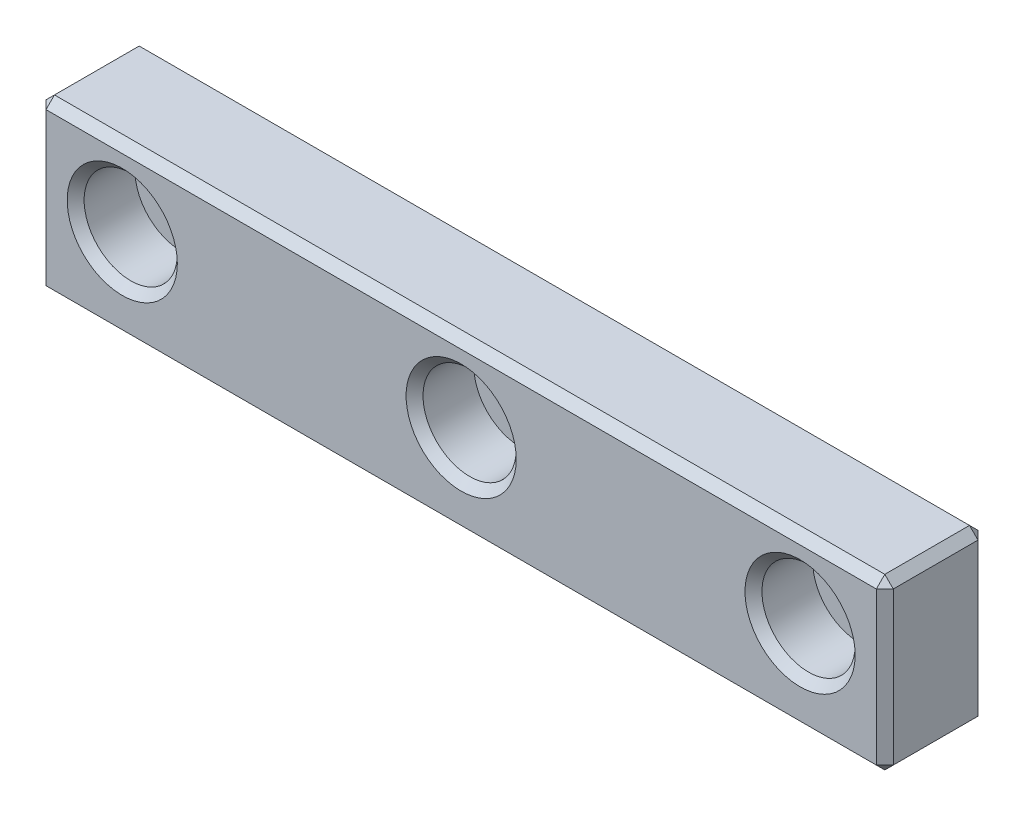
ISO-10303-21;
HEADER;
FILE_DESCRIPTION(('STEP AP214'),'2;1');
FILE_NAME('part.step','',(''),(''),'','','');
FILE_SCHEMA(('AUTOMOTIVE_DESIGN { 1 0 10303 214 1 1 1 1 }'));
ENDSEC;
DATA;
#1=APPLICATION_CONTEXT('core data for automotive mechanical design processes');
#2=APPLICATION_PROTOCOL_DEFINITION('international standard','automotive_design',2000,#1);
#3=PRODUCT_CONTEXT('',#1,'mechanical');
#4=PRODUCT('Part','Part','',(#3));
#5=PRODUCT_RELATED_PRODUCT_CATEGORY('part','',(#4));
#6=PRODUCT_DEFINITION_FORMATION('','',#4);
#7=PRODUCT_DEFINITION_CONTEXT('part definition',#1,'design');
#8=PRODUCT_DEFINITION('design','',#6,#7);
#9=PRODUCT_DEFINITION_SHAPE('','',#8);
#10=(LENGTH_UNIT() NAMED_UNIT(*) SI_UNIT(.MILLI.,.METRE.));
#11=(NAMED_UNIT(*) PLANE_ANGLE_UNIT() SI_UNIT($,.RADIAN.));
#12=(NAMED_UNIT(*) SI_UNIT($,.STERADIAN.) SOLID_ANGLE_UNIT());
#13=UNCERTAINTY_MEASURE_WITH_UNIT(LENGTH_MEASURE(1.E-05),#10,'distance_accuracy_value','');
#14=(GEOMETRIC_REPRESENTATION_CONTEXT(3) GLOBAL_UNCERTAINTY_ASSIGNED_CONTEXT((#13)) GLOBAL_UNIT_ASSIGNED_CONTEXT((#10,
#11,#12)) REPRESENTATION_CONTEXT('',''));
#15=CARTESIAN_POINT('',(0.,0.,0.));
#16=DIRECTION('',(0.,0.,1.));
#17=DIRECTION('',(1.,0.,0.));
#18=AXIS2_PLACEMENT_3D('',#15,#16,#17);
#19=CARTESIAN_POINT('',(-40.,1.,12.));
#20=DIRECTION('',(0.,0.,-1.));
#21=DIRECTION('',(-1.,0.,0.));
#22=AXIS2_PLACEMENT_3D('',#19,#20,#21);
#23=CYLINDRICAL_SURFACE('',#22,3.);
#24=CARTESIAN_POINT('',(-40.,1.,1.00000000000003));
#25=DIRECTION('',(0.,0.,1.));
#26=DIRECTION('',(1.,0.,0.));
#27=AXIS2_PLACEMENT_3D('',#24,#25,#26);
#28=CIRCLE('',#27,3.);
#29=CARTESIAN_POINT('',(-37.,1.,1.00000000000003));
#30=VERTEX_POINT('',#29);
#31=EDGE_CURVE('E162',#30,#30,#28,.F.);
#32=ORIENTED_EDGE('',*,*,#31,.T.);
#33=EDGE_LOOP('',(#32));
#34=FACE_BOUND('',#33,.T.);
#35=CARTESIAN_POINT('',(-40.,1.,5.));
#36=DIRECTION('',(0.,0.,1.));
#37=DIRECTION('',(1.,0.,0.));
#38=AXIS2_PLACEMENT_3D('',#35,#36,#37);
#39=CIRCLE('',#38,3.);
#40=CARTESIAN_POINT('',(-37.,1.,5.));
#41=VERTEX_POINT('',#40);
#42=EDGE_CURVE('E137',#41,#41,#39,.T.);
#43=ORIENTED_EDGE('',*,*,#42,.T.);
#44=EDGE_LOOP('',(#43));
#45=FACE_BOUND('',#44,.T.);
#46=ADVANCED_FACE('F16',(#34,#45),#23,.F.);
#47=CARTESIAN_POINT('',(0.,1.,12.));
#48=DIRECTION('',(0.,0.,-1.));
#49=DIRECTION('',(-1.,0.,0.));
#50=AXIS2_PLACEMENT_3D('',#47,#48,#49);
#51=CYLINDRICAL_SURFACE('',#50,3.);
#52=CARTESIAN_POINT('',(0.,1.,1.));
#53=DIRECTION('',(0.,0.,1.));
#54=DIRECTION('',(1.,0.,0.));
#55=AXIS2_PLACEMENT_3D('',#52,#53,#54);
#56=CIRCLE('',#55,3.);
#57=CARTESIAN_POINT('',(3.00000000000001,1.,1.));
#58=VERTEX_POINT('',#57);
#59=EDGE_CURVE('E159',#58,#58,#56,.F.);
#60=ORIENTED_EDGE('',*,*,#59,.T.);
#61=EDGE_LOOP('',(#60));
#62=FACE_BOUND('',#61,.T.);
#63=CARTESIAN_POINT('',(0.,1.,5.));
#64=DIRECTION('',(0.,0.,1.));
#65=DIRECTION('',(1.,0.,0.));
#66=AXIS2_PLACEMENT_3D('',#63,#64,#65);
#67=CIRCLE('',#66,3.);
#68=CARTESIAN_POINT('',(3.00000000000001,1.,5.));
#69=VERTEX_POINT('',#68);
#70=EDGE_CURVE('E293',#69,#69,#67,.T.);
#71=ORIENTED_EDGE('',*,*,#70,.T.);
#72=EDGE_LOOP('',(#71));
#73=FACE_BOUND('',#72,.T.);
#74=ADVANCED_FACE('F322',(#62,#73),#51,.F.);
#75=CARTESIAN_POINT('',(40.,1.,12.));
#76=DIRECTION('',(0.,0.,-1.));
#77=DIRECTION('',(-1.,0.,0.));
#78=AXIS2_PLACEMENT_3D('',#75,#76,#77);
#79=CYLINDRICAL_SURFACE('',#78,3.);
#80=CARTESIAN_POINT('',(40.,1.,1.00000000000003));
#81=DIRECTION('',(0.,0.,1.));
#82=DIRECTION('',(1.,0.,0.));
#83=AXIS2_PLACEMENT_3D('',#80,#81,#82);
#84=CIRCLE('',#83,3.);
#85=CARTESIAN_POINT('',(43.,1.,1.00000000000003));
#86=VERTEX_POINT('',#85);
#87=EDGE_CURVE('E156',#86,#86,#84,.F.);
#88=ORIENTED_EDGE('',*,*,#87,.T.);
#89=EDGE_LOOP('',(#88));
#90=FACE_BOUND('',#89,.T.);
#91=CARTESIAN_POINT('',(40.,1.,5.));
#92=DIRECTION('',(0.,0.,1.));
#93=DIRECTION('',(1.,0.,0.));
#94=AXIS2_PLACEMENT_3D('',#91,#92,#93);
#95=CIRCLE('',#94,3.);
#96=CARTESIAN_POINT('',(43.,1.,5.));
#97=VERTEX_POINT('',#96);
#98=EDGE_CURVE('E290',#97,#97,#95,.T.);
#99=ORIENTED_EDGE('',*,*,#98,.T.);
#100=EDGE_LOOP('',(#99));
#101=FACE_BOUND('',#100,.T.);
#102=ADVANCED_FACE('F329',(#90,#101),#79,.F.);
#103=CARTESIAN_POINT('',(0.,0.,12.));
#104=DIRECTION('',(0.,0.,1.));
#105=DIRECTION('',(1.,0.,0.));
#106=AXIS2_PLACEMENT_3D('',#103,#104,#105);
#107=PLANE('',#106);
#108=DIRECTION('',(0.,1.,0.));
#109=VECTOR('',#108,1.);
#110=CARTESIAN_POINT('',(49.,10.,12.));
#111=LINE('',#110,#109);
#112=CARTESIAN_POINT('',(49.,-9.,12.));
#113=VERTEX_POINT('',#112);
#114=CARTESIAN_POINT('',(49.,9.,12.));
#115=VERTEX_POINT('',#114);
#116=EDGE_CURVE('E33',#113,#115,#111,.T.);
#117=ORIENTED_EDGE('',*,*,#116,.T.);
#118=DIRECTION('',(-1.,0.,0.));
#119=VECTOR('',#118,1.);
#120=CARTESIAN_POINT('',(-50.,9.,12.));
#121=LINE('',#120,#119);
#122=CARTESIAN_POINT('',(-49.,9.,12.));
#123=VERTEX_POINT('',#122);
#124=EDGE_CURVE('E212',#115,#123,#121,.T.);
#125=ORIENTED_EDGE('',*,*,#124,.T.);
#126=DIRECTION('',(0.,-1.,0.));
#127=VECTOR('',#126,1.);
#128=CARTESIAN_POINT('',(-49.,-10.,12.));
#129=LINE('',#128,#127);
#130=CARTESIAN_POINT('',(-49.,-9.,12.));
#131=VERTEX_POINT('',#130);
#132=EDGE_CURVE('E208',#123,#131,#129,.T.);
#133=ORIENTED_EDGE('',*,*,#132,.T.);
#134=DIRECTION('',(1.,0.,0.));
#135=VECTOR('',#134,1.);
#136=CARTESIAN_POINT('',(50.,-9.,12.));
#137=LINE('',#136,#135);
#138=EDGE_CURVE('E38',#131,#113,#137,.T.);
#139=ORIENTED_EDGE('',*,*,#138,.T.);
#140=EDGE_LOOP('',(#117,#125,#133,#139));
#141=FACE_BOUND('',#140,.T.);
#142=CARTESIAN_POINT('',(40.,1.,12.));
#143=DIRECTION('',(0.,0.,1.));
#144=DIRECTION('',(1.,0.,0.));
#145=AXIS2_PLACEMENT_3D('',#142,#143,#144);
#146=CIRCLE('',#145,6.5);
#147=CARTESIAN_POINT('',(46.5,1.,12.));
#148=VERTEX_POINT('',#147);
#149=EDGE_CURVE('E205',#148,#148,#146,.F.);
#150=ORIENTED_EDGE('',*,*,#149,.T.);
#151=EDGE_LOOP('',(#150));
#152=FACE_BOUND('',#151,.T.);
#153=CARTESIAN_POINT('',(0.,1.,12.));
#154=DIRECTION('',(0.,0.,1.));
#155=DIRECTION('',(1.,0.,0.));
#156=AXIS2_PLACEMENT_3D('',#153,#154,#155);
#157=CIRCLE('',#156,6.5);
#158=CARTESIAN_POINT('',(6.50000000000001,1.,12.));
#159=VERTEX_POINT('',#158);
#160=EDGE_CURVE('E202',#159,#159,#157,.F.);
#161=ORIENTED_EDGE('',*,*,#160,.T.);
#162=EDGE_LOOP('',(#161));
#163=FACE_BOUND('',#162,.T.);
#164=CARTESIAN_POINT('',(-40.,1.,12.));
#165=DIRECTION('',(0.,0.,1.));
#166=DIRECTION('',(1.,0.,0.));
#167=AXIS2_PLACEMENT_3D('',#164,#165,#166);
#168=CIRCLE('',#167,6.5);
#169=CARTESIAN_POINT('',(-33.5,1.,12.));
#170=VERTEX_POINT('',#169);
#171=EDGE_CURVE('E199',#170,#170,#168,.F.);
#172=ORIENTED_EDGE('',*,*,#171,.T.);
#173=EDGE_LOOP('',(#172));
#174=FACE_BOUND('',#173,.T.);
#175=ADVANCED_FACE('F334',(#141,#152,#163,#174),#107,.T.);
#176=CARTESIAN_POINT('',(0.,0.,0.));
#177=DIRECTION('',(0.,0.,1.));
#178=DIRECTION('',(1.,0.,0.));
#179=AXIS2_PLACEMENT_3D('',#176,#177,#178);
#180=PLANE('',#179);
#181=CARTESIAN_POINT('',(40.,1.,0.));
#182=DIRECTION('',(0.,0.,1.));
#183=DIRECTION('',(1.,0.,0.));
#184=AXIS2_PLACEMENT_3D('',#181,#182,#183);
#185=CIRCLE('',#184,4.);
#186=CARTESIAN_POINT('',(44.,1.,0.));
#187=VERTEX_POINT('',#186);
#188=EDGE_CURVE('E153',#187,#187,#185,.T.);
#189=ORIENTED_EDGE('',*,*,#188,.T.);
#190=EDGE_LOOP('',(#189));
#191=FACE_BOUND('',#190,.T.);
#192=CARTESIAN_POINT('',(0.,1.,0.));
#193=DIRECTION('',(0.,0.,1.));
#194=DIRECTION('',(1.,0.,0.));
#195=AXIS2_PLACEMENT_3D('',#192,#193,#194);
#196=CIRCLE('',#195,4.);
#197=CARTESIAN_POINT('',(4.00000000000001,1.,0.));
#198=VERTEX_POINT('',#197);
#199=EDGE_CURVE('E150',#198,#198,#196,.T.);
#200=ORIENTED_EDGE('',*,*,#199,.T.);
#201=EDGE_LOOP('',(#200));
#202=FACE_BOUND('',#201,.T.);
#203=CARTESIAN_POINT('',(-40.,1.,0.));
#204=DIRECTION('',(0.,0.,1.));
#205=DIRECTION('',(1.,0.,0.));
#206=AXIS2_PLACEMENT_3D('',#203,#204,#205);
#207=CIRCLE('',#206,4.);
#208=CARTESIAN_POINT('',(-36.,1.,0.));
#209=VERTEX_POINT('',#208);
#210=EDGE_CURVE('E144',#209,#209,#207,.T.);
#211=ORIENTED_EDGE('',*,*,#210,.T.);
#212=EDGE_LOOP('',(#211));
#213=FACE_BOUND('',#212,.T.);
#214=DIRECTION('',(0.,1.,0.));
#215=VECTOR('',#214,1.);
#216=CARTESIAN_POINT('',(-49.,0.,0.));
#217=LINE('',#216,#215);
#218=CARTESIAN_POINT('',(-49.,-9.,0.));
#219=VERTEX_POINT('',#218);
#220=CARTESIAN_POINT('',(-49.,9.,0.));
#221=VERTEX_POINT('',#220);
#222=EDGE_CURVE('E136',#219,#221,#217,.T.);
#223=ORIENTED_EDGE('',*,*,#222,.T.);
#224=DIRECTION('',(1.,0.,0.));
#225=VECTOR('',#224,1.);
#226=CARTESIAN_POINT('',(0.,9.,0.));
#227=LINE('',#226,#225);
#228=CARTESIAN_POINT('',(49.,9.,0.));
#229=VERTEX_POINT('',#228);
#230=EDGE_CURVE('E141',#221,#229,#227,.T.);
#231=ORIENTED_EDGE('',*,*,#230,.T.);
#232=DIRECTION('',(0.,-1.,0.));
#233=VECTOR('',#232,1.);
#234=CARTESIAN_POINT('',(49.,0.,0.));
#235=LINE('',#234,#233);
#236=CARTESIAN_POINT('',(49.,-9.,0.));
#237=VERTEX_POINT('',#236);
#238=EDGE_CURVE('E111',#229,#237,#235,.T.);
#239=ORIENTED_EDGE('',*,*,#238,.T.);
#240=DIRECTION('',(-1.,0.,0.));
#241=VECTOR('',#240,1.);
#242=CARTESIAN_POINT('',(0.,-9.,0.));
#243=LINE('',#242,#241);
#244=EDGE_CURVE('E130',#237,#219,#243,.T.);
#245=ORIENTED_EDGE('',*,*,#244,.T.);
#246=EDGE_LOOP('',(#223,#231,#239,#245));
#247=FACE_BOUND('',#246,.T.);
#248=ADVANCED_FACE('F139',(#191,#202,#213,#247),#180,.F.);
#249=CARTESIAN_POINT('',(-50.,-10.,12.));
#250=DIRECTION('',(1.,0.,0.));
#251=DIRECTION('',(0.,0.,-1.));
#252=AXIS2_PLACEMENT_3D('',#249,#250,#251);
#253=PLANE('',#252);
#254=DIRECTION('',(0.,0.,-1.));
#255=VECTOR('',#254,1.);
#256=CARTESIAN_POINT('',(-50.,9.,12.));
#257=LINE('',#256,#255);
#258=CARTESIAN_POINT('',(-50.,9.,11.));
#259=VERTEX_POINT('',#258);
#260=CARTESIAN_POINT('',(-50.,9.,1.00000000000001));
#261=VERTEX_POINT('',#260);
#262=EDGE_CURVE('E176',#259,#261,#257,.T.);
#263=ORIENTED_EDGE('',*,*,#262,.T.);
#264=DIRECTION('',(0.,-1.,0.));
#265=VECTOR('',#264,1.);
#266=CARTESIAN_POINT('',(-50.,-10.,1.00000000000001));
#267=LINE('',#266,#265);
#268=CARTESIAN_POINT('',(-50.,-9.,1.00000000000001));
#269=VERTEX_POINT('',#268);
#270=EDGE_CURVE('E178',#261,#269,#267,.T.);
#271=ORIENTED_EDGE('',*,*,#270,.T.);
#272=DIRECTION('',(0.,0.,1.));
#273=VECTOR('',#272,1.);
#274=CARTESIAN_POINT('',(-50.,-9.,12.));
#275=LINE('',#274,#273);
#276=CARTESIAN_POINT('',(-50.,-9.,11.));
#277=VERTEX_POINT('',#276);
#278=EDGE_CURVE('E174',#269,#277,#275,.T.);
#279=ORIENTED_EDGE('',*,*,#278,.T.);
#280=DIRECTION('',(0.,1.,0.));
#281=VECTOR('',#280,1.);
#282=CARTESIAN_POINT('',(-50.,10.,11.));
#283=LINE('',#282,#281);
#284=EDGE_CURVE('E172',#277,#259,#283,.T.);
#285=ORIENTED_EDGE('',*,*,#284,.T.);
#286=EDGE_LOOP('',(#263,#271,#279,#285));
#287=FACE_BOUND('',#286,.T.);
#288=ADVANCED_FACE('F339',(#287),#253,.F.);
#289=CARTESIAN_POINT('',(50.,-10.,12.));
#290=DIRECTION('',(0.,1.,0.));
#291=DIRECTION('',(-1.,0.,0.));
#292=AXIS2_PLACEMENT_3D('',#289,#290,#291);
#293=PLANE('',#292);
#294=DIRECTION('',(-1.,0.,0.));
#295=VECTOR('',#294,1.);
#296=CARTESIAN_POINT('',(-50.,-10.,11.));
#297=LINE('',#296,#295);
#298=CARTESIAN_POINT('',(49.,-10.,11.));
#299=VERTEX_POINT('',#298);
#300=CARTESIAN_POINT('',(-49.,-10.,11.));
#301=VERTEX_POINT('',#300);
#302=EDGE_CURVE('E190',#299,#301,#297,.T.);
#303=ORIENTED_EDGE('',*,*,#302,.T.);
#304=DIRECTION('',(0.,0.,-1.));
#305=VECTOR('',#304,1.);
#306=CARTESIAN_POINT('',(-49.,-10.,12.));
#307=LINE('',#306,#305);
#308=CARTESIAN_POINT('',(-49.,-10.,1.));
#309=VERTEX_POINT('',#308);
#310=EDGE_CURVE('E196',#301,#309,#307,.T.);
#311=ORIENTED_EDGE('',*,*,#310,.T.);
#312=DIRECTION('',(1.,0.,0.));
#313=VECTOR('',#312,1.);
#314=CARTESIAN_POINT('',(50.,-10.,1.));
#315=LINE('',#314,#313);
#316=CARTESIAN_POINT('',(49.,-10.,1.));
#317=VERTEX_POINT('',#316);
#318=EDGE_CURVE('E194',#309,#317,#315,.T.);
#319=ORIENTED_EDGE('',*,*,#318,.T.);
#320=DIRECTION('',(0.,0.,1.));
#321=VECTOR('',#320,1.);
#322=CARTESIAN_POINT('',(49.,-10.,12.));
#323=LINE('',#322,#321);
#324=EDGE_CURVE('E192',#317,#299,#323,.T.);
#325=ORIENTED_EDGE('',*,*,#324,.T.);
#326=EDGE_LOOP('',(#303,#311,#319,#325));
#327=FACE_BOUND('',#326,.T.);
#328=ADVANCED_FACE('F349',(#327),#293,.F.);
#329=CARTESIAN_POINT('',(50.,-10.,12.));
#330=DIRECTION('',(-1.,0.,0.));
#331=DIRECTION('',(0.,0.,1.));
#332=AXIS2_PLACEMENT_3D('',#329,#330,#331);
#333=PLANE('',#332);
#334=DIRECTION('',(0.,0.,-1.));
#335=VECTOR('',#334,1.);
#336=CARTESIAN_POINT('',(50.,-9.,12.));
#337=LINE('',#336,#335);
#338=CARTESIAN_POINT('',(50.,-9.,11.));
#339=VERTEX_POINT('',#338);
#340=CARTESIAN_POINT('',(50.,-9.,1.));
#341=VERTEX_POINT('',#340);
#342=EDGE_CURVE('E167',#339,#341,#337,.T.);
#343=ORIENTED_EDGE('',*,*,#342,.T.);
#344=DIRECTION('',(0.,1.,0.));
#345=VECTOR('',#344,1.);
#346=CARTESIAN_POINT('',(50.,-10.,1.));
#347=LINE('',#346,#345);
#348=CARTESIAN_POINT('',(50.,9.,1.));
#349=VERTEX_POINT('',#348);
#350=EDGE_CURVE('E114',#341,#349,#347,.T.);
#351=ORIENTED_EDGE('',*,*,#350,.T.);
#352=DIRECTION('',(0.,0.,1.));
#353=VECTOR('',#352,1.);
#354=CARTESIAN_POINT('',(50.,9.,12.));
#355=LINE('',#354,#353);
#356=CARTESIAN_POINT('',(50.,9.,11.));
#357=VERTEX_POINT('',#356);
#358=EDGE_CURVE('E169',#349,#357,#355,.T.);
#359=ORIENTED_EDGE('',*,*,#358,.T.);
#360=DIRECTION('',(0.,-1.,0.));
#361=VECTOR('',#360,1.);
#362=CARTESIAN_POINT('',(50.,-10.,11.));
#363=LINE('',#362,#361);
#364=EDGE_CURVE('E165',#357,#339,#363,.T.);
#365=ORIENTED_EDGE('',*,*,#364,.T.);
#366=EDGE_LOOP('',(#343,#351,#359,#365));
#367=FACE_BOUND('',#366,.T.);
#368=ADVANCED_FACE('F345',(#367),#333,.F.);
#369=CARTESIAN_POINT('',(50.,10.,12.));
#370=DIRECTION('',(0.,-1.,0.));
#371=DIRECTION('',(1.,0.,0.));
#372=AXIS2_PLACEMENT_3D('',#369,#370,#371);
#373=PLANE('',#372);
#374=DIRECTION('',(1.,0.,0.));
#375=VECTOR('',#374,1.);
#376=CARTESIAN_POINT('',(50.,10.,11.));
#377=LINE('',#376,#375);
#378=CARTESIAN_POINT('',(-49.,10.,11.));
#379=VERTEX_POINT('',#378);
#380=CARTESIAN_POINT('',(49.,10.,11.));
#381=VERTEX_POINT('',#380);
#382=EDGE_CURVE('E181',#379,#381,#377,.T.);
#383=ORIENTED_EDGE('',*,*,#382,.T.);
#384=DIRECTION('',(0.,0.,-1.));
#385=VECTOR('',#384,1.);
#386=CARTESIAN_POINT('',(49.,10.,12.));
#387=LINE('',#386,#385);
#388=CARTESIAN_POINT('',(49.,10.,1.));
#389=VERTEX_POINT('',#388);
#390=EDGE_CURVE('E187',#381,#389,#387,.T.);
#391=ORIENTED_EDGE('',*,*,#390,.T.);
#392=DIRECTION('',(-1.,0.,0.));
#393=VECTOR('',#392,1.);
#394=CARTESIAN_POINT('',(50.,10.,1.));
#395=LINE('',#394,#393);
#396=CARTESIAN_POINT('',(-49.,10.,1.));
#397=VERTEX_POINT('',#396);
#398=EDGE_CURVE('E185',#389,#397,#395,.T.);
#399=ORIENTED_EDGE('',*,*,#398,.T.);
#400=DIRECTION('',(0.,0.,1.));
#401=VECTOR('',#400,1.);
#402=CARTESIAN_POINT('',(-49.,10.,12.));
#403=LINE('',#402,#401);
#404=EDGE_CURVE('E183',#397,#379,#403,.T.);
#405=ORIENTED_EDGE('',*,*,#404,.T.);
#406=EDGE_LOOP('',(#383,#391,#399,#405));
#407=FACE_BOUND('',#406,.T.);
#408=ADVANCED_FACE('F341',(#407),#373,.F.);
#409=CARTESIAN_POINT('',(40.,1.,5.));
#410=DIRECTION('',(0.,0.,1.));
#411=DIRECTION('',(1.,0.,0.));
#412=AXIS2_PLACEMENT_3D('',#409,#410,#411);
#413=CYLINDRICAL_SURFACE('',#412,5.5);
#414=CARTESIAN_POINT('',(40.,1.,11.));
#415=DIRECTION('',(0.,0.,1.));
#416=DIRECTION('',(1.,0.,0.));
#417=AXIS2_PLACEMENT_3D('',#414,#415,#416);
#418=CIRCLE('',#417,5.5);
#419=CARTESIAN_POINT('',(45.5,1.,11.));
#420=VERTEX_POINT('',#419);
#421=EDGE_CURVE('E214',#420,#420,#418,.T.);
#422=ORIENTED_EDGE('',*,*,#421,.T.);
#423=EDGE_LOOP('',(#422));
#424=FACE_BOUND('',#423,.T.);
#425=CARTESIAN_POINT('',(40.,1.,5.));
#426=DIRECTION('',(0.,0.,1.));
#427=DIRECTION('',(1.,0.,0.));
#428=AXIS2_PLACEMENT_3D('',#425,#426,#427);
#429=CIRCLE('',#428,5.5);
#430=CARTESIAN_POINT('',(45.5,1.,5.));
#431=VERTEX_POINT('',#430);
#432=EDGE_CURVE('E275',#431,#431,#429,.T.);
#433=ORIENTED_EDGE('',*,*,#432,.F.);
#434=EDGE_LOOP('',(#433));
#435=FACE_BOUND('',#434,.T.);
#436=ADVANCED_FACE('F344',(#424,#435),#413,.F.);
#437=CARTESIAN_POINT('',(40.,1.,5.));
#438=DIRECTION('',(0.,0.,1.));
#439=DIRECTION('',(1.,0.,0.));
#440=AXIS2_PLACEMENT_3D('',#437,#438,#439);
#441=PLANE('',#440);
#442=ORIENTED_EDGE('',*,*,#98,.F.);
#443=EDGE_LOOP('',(#442));
#444=FACE_BOUND('',#443,.T.);
#445=ORIENTED_EDGE('',*,*,#432,.T.);
#446=EDGE_LOOP('',(#445));
#447=FACE_BOUND('',#446,.T.);
#448=ADVANCED_FACE('F457',(#444,#447),#441,.T.);
#449=CARTESIAN_POINT('',(0.,1.,5.));
#450=DIRECTION('',(0.,0.,1.));
#451=DIRECTION('',(1.,0.,0.));
#452=AXIS2_PLACEMENT_3D('',#449,#450,#451);
#453=CYLINDRICAL_SURFACE('',#452,5.5);
#454=CARTESIAN_POINT('',(0.,1.,11.));
#455=DIRECTION('',(0.,0.,1.));
#456=DIRECTION('',(1.,0.,0.));
#457=AXIS2_PLACEMENT_3D('',#454,#455,#456);
#458=CIRCLE('',#457,5.5);
#459=CARTESIAN_POINT('',(5.50000000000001,1.,11.));
#460=VERTEX_POINT('',#459);
#461=EDGE_CURVE('E25',#460,#460,#458,.T.);
#462=ORIENTED_EDGE('',*,*,#461,.T.);
#463=EDGE_LOOP('',(#462));
#464=FACE_BOUND('',#463,.T.);
#465=CARTESIAN_POINT('',(0.,1.,5.));
#466=DIRECTION('',(0.,0.,1.));
#467=DIRECTION('',(1.,0.,0.));
#468=AXIS2_PLACEMENT_3D('',#465,#466,#467);
#469=CIRCLE('',#468,5.5);
#470=CARTESIAN_POINT('',(5.50000000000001,1.,5.));
#471=VERTEX_POINT('',#470);
#472=EDGE_CURVE('E281',#471,#471,#469,.T.);
#473=ORIENTED_EDGE('',*,*,#472,.F.);
#474=EDGE_LOOP('',(#473));
#475=FACE_BOUND('',#474,.T.);
#476=ADVANCED_FACE('F318',(#464,#475),#453,.F.);
#477=CARTESIAN_POINT('',(0.,1.,5.));
#478=DIRECTION('',(0.,0.,1.));
#479=DIRECTION('',(1.,0.,0.));
#480=AXIS2_PLACEMENT_3D('',#477,#478,#479);
#481=PLANE('',#480);
#482=ORIENTED_EDGE('',*,*,#70,.F.);
#483=EDGE_LOOP('',(#482));
#484=FACE_BOUND('',#483,.T.);
#485=ORIENTED_EDGE('',*,*,#472,.T.);
#486=EDGE_LOOP('',(#485));
#487=FACE_BOUND('',#486,.T.);
#488=ADVANCED_FACE('F310',(#484,#487),#481,.T.);
#489=CARTESIAN_POINT('',(-40.,1.,5.));
#490=DIRECTION('',(0.,0.,1.));
#491=DIRECTION('',(1.,0.,0.));
#492=AXIS2_PLACEMENT_3D('',#489,#490,#491);
#493=CYLINDRICAL_SURFACE('',#492,5.5);
#494=CARTESIAN_POINT('',(-40.,1.,11.));
#495=DIRECTION('',(0.,0.,1.));
#496=DIRECTION('',(1.,0.,0.));
#497=AXIS2_PLACEMENT_3D('',#494,#495,#496);
#498=CIRCLE('',#497,5.5);
#499=CARTESIAN_POINT('',(-34.5,1.,11.));
#500=VERTEX_POINT('',#499);
#501=EDGE_CURVE('E10',#500,#500,#498,.T.);
#502=ORIENTED_EDGE('',*,*,#501,.T.);
#503=EDGE_LOOP('',(#502));
#504=FACE_BOUND('',#503,.T.);
#505=CARTESIAN_POINT('',(-40.,1.,5.));
#506=DIRECTION('',(0.,0.,1.));
#507=DIRECTION('',(1.,0.,0.));
#508=AXIS2_PLACEMENT_3D('',#505,#506,#507);
#509=CIRCLE('',#508,5.5);
#510=CARTESIAN_POINT('',(-34.5,1.,5.));
#511=VERTEX_POINT('',#510);
#512=EDGE_CURVE('E286',#511,#511,#509,.T.);
#513=ORIENTED_EDGE('',*,*,#512,.F.);
#514=EDGE_LOOP('',(#513));
#515=FACE_BOUND('',#514,.T.);
#516=ADVANCED_FACE('F304',(#504,#515),#493,.F.);
#517=CARTESIAN_POINT('',(-40.,1.,5.));
#518=DIRECTION('',(0.,0.,1.));
#519=DIRECTION('',(1.,0.,0.));
#520=AXIS2_PLACEMENT_3D('',#517,#518,#519);
#521=PLANE('',#520);
#522=ORIENTED_EDGE('',*,*,#42,.F.);
#523=EDGE_LOOP('',(#522));
#524=FACE_BOUND('',#523,.T.);
#525=ORIENTED_EDGE('',*,*,#512,.T.);
#526=EDGE_LOOP('',(#525));
#527=FACE_BOUND('',#526,.T.);
#528=ADVANCED_FACE('F300',(#524,#527),#521,.T.);
#529=CARTESIAN_POINT('',(40.,1.,0.));
#530=DIRECTION('',(0.,0.,-1.));
#531=DIRECTION('',(-1.,0.,0.));
#532=AXIS2_PLACEMENT_3D('',#529,#530,#531);
#533=CONICAL_SURFACE('',#532,4.,0.785398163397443);
#534=ORIENTED_EDGE('',*,*,#87,.F.);
#535=EDGE_LOOP('',(#534));
#536=FACE_BOUND('',#535,.T.);
#537=ORIENTED_EDGE('',*,*,#188,.F.);
#538=EDGE_LOOP('',(#537));
#539=FACE_BOUND('',#538,.T.);
#540=ADVANCED_FACE('F303',(#536,#539),#533,.F.);
#541=CARTESIAN_POINT('',(0.,1.,0.));
#542=DIRECTION('',(0.,0.,-1.));
#543=DIRECTION('',(-1.,0.,0.));
#544=AXIS2_PLACEMENT_3D('',#541,#542,#543);
#545=CONICAL_SURFACE('',#544,4.,0.785398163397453);
#546=ORIENTED_EDGE('',*,*,#59,.F.);
#547=EDGE_LOOP('',(#546));
#548=FACE_BOUND('',#547,.T.);
#549=ORIENTED_EDGE('',*,*,#199,.F.);
#550=EDGE_LOOP('',(#549));
#551=FACE_BOUND('',#550,.T.);
#552=ADVANCED_FACE('F359',(#548,#551),#545,.F.);
#553=CARTESIAN_POINT('',(-40.,1.,0.));
#554=DIRECTION('',(0.,0.,-1.));
#555=DIRECTION('',(-1.,0.,0.));
#556=AXIS2_PLACEMENT_3D('',#553,#554,#555);
#557=CONICAL_SURFACE('',#556,4.,0.785398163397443);
#558=ORIENTED_EDGE('',*,*,#31,.F.);
#559=EDGE_LOOP('',(#558));
#560=FACE_BOUND('',#559,.T.);
#561=ORIENTED_EDGE('',*,*,#210,.F.);
#562=EDGE_LOOP('',(#561));
#563=FACE_BOUND('',#562,.T.);
#564=ADVANCED_FACE('F363',(#560,#563),#557,.F.);
#565=CARTESIAN_POINT('',(-49.,0.,12.));
#566=DIRECTION('',(-0.707106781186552,0.,0.707106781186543));
#567=DIRECTION('',(0.,1.,0.));
#568=AXIS2_PLACEMENT_3D('',#565,#566,#567);
#569=PLANE('',#568);
#570=DIRECTION('',(-0.707106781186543,0.,-0.707106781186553));
#571=VECTOR('',#570,1.);
#572=CARTESIAN_POINT('',(-50.,-9.,11.));
#573=LINE('',#572,#571);
#574=EDGE_CURVE('E20',#131,#277,#573,.T.);
#575=ORIENTED_EDGE('',*,*,#574,.F.);
#576=ORIENTED_EDGE('',*,*,#132,.F.);
#577=DIRECTION('',(0.707106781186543,0.,0.707106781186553));
#578=VECTOR('',#577,1.);
#579=CARTESIAN_POINT('',(-49.5,9.,11.5));
#580=LINE('',#579,#578);
#581=EDGE_CURVE('E267',#259,#123,#580,.T.);
#582=ORIENTED_EDGE('',*,*,#581,.F.);
#583=ORIENTED_EDGE('',*,*,#284,.F.);
#584=EDGE_LOOP('',(#575,#576,#582,#583));
#585=FACE_BOUND('',#584,.T.);
#586=ADVANCED_FACE('F367',(#585),#569,.T.);
#587=CARTESIAN_POINT('',(-50.,-9.,11.));
#588=DIRECTION('',(-0.577350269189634,-0.577350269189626,0.577350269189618));
#589=DIRECTION('',(0.707106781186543,-0.707106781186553,0.));
#590=AXIS2_PLACEMENT_3D('',#587,#588,#589);
#591=PLANE('',#590);
#592=DIRECTION('',(0.,0.707106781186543,0.707106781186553));
#593=VECTOR('',#592,1.);
#594=CARTESIAN_POINT('',(-49.,-9.5,11.5));
#595=LINE('',#594,#593);
#596=EDGE_CURVE('E262',#131,#301,#595,.F.);
#597=ORIENTED_EDGE('',*,*,#596,.F.);
#598=ORIENTED_EDGE('',*,*,#574,.T.);
#599=DIRECTION('',(-0.707106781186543,0.707106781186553,0.));
#600=VECTOR('',#599,1.);
#601=CARTESIAN_POINT('',(-50.,-9.,11.));
#602=LINE('',#601,#600);
#603=EDGE_CURVE('E265',#301,#277,#602,.T.);
#604=ORIENTED_EDGE('',*,*,#603,.F.);
#605=EDGE_LOOP('',(#597,#598,#604));
#606=FACE_BOUND('',#605,.T.);
#607=ADVANCED_FACE('F435',(#606),#591,.T.);
#608=CARTESIAN_POINT('',(-49.,10.,11.));
#609=DIRECTION('',(-0.577350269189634,0.577350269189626,0.577350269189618));
#610=DIRECTION('',(-0.707106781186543,-0.707106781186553,0.));
#611=AXIS2_PLACEMENT_3D('',#608,#609,#610);
#612=PLANE('',#611);
#613=DIRECTION('',(0.707106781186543,0.707106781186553,0.));
#614=VECTOR('',#613,1.);
#615=CARTESIAN_POINT('',(-49.,10.,11.));
#616=LINE('',#615,#614);
#617=EDGE_CURVE('E257',#259,#379,#616,.T.);
#618=ORIENTED_EDGE('',*,*,#617,.F.);
#619=ORIENTED_EDGE('',*,*,#581,.T.);
#620=DIRECTION('',(0.,0.707106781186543,-0.707106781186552));
#621=VECTOR('',#620,1.);
#622=CARTESIAN_POINT('',(-49.,10.,11.));
#623=LINE('',#622,#621);
#624=EDGE_CURVE('E260',#379,#123,#623,.F.);
#625=ORIENTED_EDGE('',*,*,#624,.F.);
#626=EDGE_LOOP('',(#618,#619,#625));
#627=FACE_BOUND('',#626,.T.);
#628=ADVANCED_FACE('F431',(#627),#612,.T.);
#629=CARTESIAN_POINT('',(-49.,-10.,12.));
#630=DIRECTION('',(0.707106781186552,0.707106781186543,0.));
#631=DIRECTION('',(0.,0.,-1.));
#632=AXIS2_PLACEMENT_3D('',#629,#630,#631);
#633=PLANE('',#632);
#634=ORIENTED_EDGE('',*,*,#603,.T.);
#635=ORIENTED_EDGE('',*,*,#278,.F.);
#636=DIRECTION('',(0.707106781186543,-0.707106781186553,0.));
#637=VECTOR('',#636,1.);
#638=CARTESIAN_POINT('',(-50.,-9.,1.00000000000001));
#639=LINE('',#638,#637);
#640=EDGE_CURVE('E252',#309,#269,#639,.F.);
#641=ORIENTED_EDGE('',*,*,#640,.F.);
#642=ORIENTED_EDGE('',*,*,#310,.F.);
#643=EDGE_LOOP('',(#634,#635,#641,#642));
#644=FACE_BOUND('',#643,.T.);
#645=ADVANCED_FACE('F427',(#644),#633,.F.);
#646=CARTESIAN_POINT('',(0.,-9.,12.));
#647=DIRECTION('',(0.,-0.707106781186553,0.707106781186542));
#648=DIRECTION('',(-1.,0.,0.));
#649=AXIS2_PLACEMENT_3D('',#646,#647,#648);
#650=PLANE('',#649);
#651=ORIENTED_EDGE('',*,*,#596,.T.);
#652=ORIENTED_EDGE('',*,*,#302,.F.);
#653=DIRECTION('',(0.,-0.707106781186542,-0.707106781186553));
#654=VECTOR('',#653,1.);
#655=CARTESIAN_POINT('',(49.,-10.,11.));
#656=LINE('',#655,#654);
#657=EDGE_CURVE('E249',#113,#299,#656,.T.);
#658=ORIENTED_EDGE('',*,*,#657,.F.);
#659=ORIENTED_EDGE('',*,*,#138,.F.);
#660=EDGE_LOOP('',(#651,#652,#658,#659));
#661=FACE_BOUND('',#660,.T.);
#662=ADVANCED_FACE('F423',(#661),#650,.T.);
#663=CARTESIAN_POINT('',(49.,0.,12.));
#664=DIRECTION('',(0.707106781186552,0.,0.707106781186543));
#665=DIRECTION('',(0.,-1.,0.));
#666=AXIS2_PLACEMENT_3D('',#663,#664,#665);
#667=PLANE('',#666);
#668=DIRECTION('',(0.707106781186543,0.,-0.707106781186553));
#669=VECTOR('',#668,1.);
#670=CARTESIAN_POINT('',(50.,9.,11.));
#671=LINE('',#670,#669);
#672=EDGE_CURVE('E243',#115,#357,#671,.T.);
#673=ORIENTED_EDGE('',*,*,#672,.F.);
#674=ORIENTED_EDGE('',*,*,#116,.F.);
#675=DIRECTION('',(-0.707106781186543,0.,0.707106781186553));
#676=VECTOR('',#675,1.);
#677=CARTESIAN_POINT('',(49.5,-9.,11.5));
#678=LINE('',#677,#676);
#679=EDGE_CURVE('E246',#339,#113,#678,.T.);
#680=ORIENTED_EDGE('',*,*,#679,.F.);
#681=ORIENTED_EDGE('',*,*,#364,.F.);
#682=EDGE_LOOP('',(#673,#674,#680,#681));
#683=FACE_BOUND('',#682,.T.);
#684=ADVANCED_FACE('F419',(#683),#667,.T.);
#685=CARTESIAN_POINT('',(0.,9.,12.));
#686=DIRECTION('',(0.,0.707106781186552,0.707106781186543));
#687=DIRECTION('',(1.,0.,0.));
#688=AXIS2_PLACEMENT_3D('',#685,#686,#687);
#689=PLANE('',#688);
#690=ORIENTED_EDGE('',*,*,#624,.T.);
#691=ORIENTED_EDGE('',*,*,#124,.F.);
#692=DIRECTION('',(0.,-0.707106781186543,0.707106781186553));
#693=VECTOR('',#692,1.);
#694=CARTESIAN_POINT('',(49.,9.5,11.5));
#695=LINE('',#694,#693);
#696=EDGE_CURVE('E240',#381,#115,#695,.T.);
#697=ORIENTED_EDGE('',*,*,#696,.F.);
#698=ORIENTED_EDGE('',*,*,#382,.F.);
#699=EDGE_LOOP('',(#690,#691,#697,#698));
#700=FACE_BOUND('',#699,.T.);
#701=ADVANCED_FACE('F415',(#700),#689,.T.);
#702=CARTESIAN_POINT('',(-50.,9.,12.));
#703=DIRECTION('',(0.707106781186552,-0.707106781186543,0.));
#704=DIRECTION('',(0.,0.,-1.));
#705=AXIS2_PLACEMENT_3D('',#702,#703,#704);
#706=PLANE('',#705);
#707=ORIENTED_EDGE('',*,*,#617,.T.);
#708=ORIENTED_EDGE('',*,*,#404,.F.);
#709=DIRECTION('',(-0.707106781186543,-0.707106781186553,0.));
#710=VECTOR('',#709,1.);
#711=CARTESIAN_POINT('',(-49.5,9.5,1.));
#712=LINE('',#711,#710);
#713=EDGE_CURVE('E237',#261,#397,#712,.F.);
#714=ORIENTED_EDGE('',*,*,#713,.F.);
#715=ORIENTED_EDGE('',*,*,#262,.F.);
#716=EDGE_LOOP('',(#707,#708,#714,#715));
#717=FACE_BOUND('',#716,.T.);
#718=ADVANCED_FACE('F411',(#717),#706,.F.);
#719=CARTESIAN_POINT('',(-50.,-10.,1.00000000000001));
#720=DIRECTION('',(0.707106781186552,0.,0.707106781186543));
#721=DIRECTION('',(0.,-1.,0.));
#722=AXIS2_PLACEMENT_3D('',#719,#720,#721);
#723=PLANE('',#722);
#724=DIRECTION('',(-0.707106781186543,0.,0.707106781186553));
#725=VECTOR('',#724,1.);
#726=CARTESIAN_POINT('',(-50.,-9.,1.00000000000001));
#727=LINE('',#726,#725);
#728=EDGE_CURVE('E254',#269,#219,#727,.F.);
#729=ORIENTED_EDGE('',*,*,#728,.F.);
#730=ORIENTED_EDGE('',*,*,#270,.F.);
#731=DIRECTION('',(0.707106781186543,0.,-0.707106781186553));
#732=VECTOR('',#731,1.);
#733=CARTESIAN_POINT('',(-49.,9.,0.));
#734=LINE('',#733,#732);
#735=EDGE_CURVE('E234',#221,#261,#734,.F.);
#736=ORIENTED_EDGE('',*,*,#735,.F.);
#737=ORIENTED_EDGE('',*,*,#222,.F.);
#738=EDGE_LOOP('',(#729,#730,#736,#737));
#739=FACE_BOUND('',#738,.T.);
#740=ADVANCED_FACE('F407',(#739),#723,.F.);
#741=CARTESIAN_POINT('',(-50.,-9.,1.00000000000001));
#742=DIRECTION('',(-0.577350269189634,-0.577350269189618,-0.577350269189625));
#743=DIRECTION('',(-0.707106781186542,0.,0.707106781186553));
#744=AXIS2_PLACEMENT_3D('',#741,#742,#743);
#745=PLANE('',#744);
#746=ORIENTED_EDGE('',*,*,#640,.T.);
#747=ORIENTED_EDGE('',*,*,#728,.T.);
#748=DIRECTION('',(0.,0.707106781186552,-0.707106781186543));
#749=VECTOR('',#748,1.);
#750=CARTESIAN_POINT('',(-49.,-9.5,0.5));
#751=LINE('',#750,#749);
#752=EDGE_CURVE('E133',#309,#219,#751,.T.);
#753=ORIENTED_EDGE('',*,*,#752,.F.);
#754=EDGE_LOOP('',(#746,#747,#753));
#755=FACE_BOUND('',#754,.T.);
#756=ADVANCED_FACE('F403',(#755),#745,.T.);
#757=CARTESIAN_POINT('',(49.,-10.,11.));
#758=DIRECTION('',(0.577350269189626,-0.577350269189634,0.577350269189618));
#759=DIRECTION('',(0.707106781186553,0.707106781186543,0.));
#760=AXIS2_PLACEMENT_3D('',#757,#758,#759);
#761=PLANE('',#760);
#762=ORIENTED_EDGE('',*,*,#679,.T.);
#763=ORIENTED_EDGE('',*,*,#657,.T.);
#764=DIRECTION('',(-0.707106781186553,-0.707106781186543,0.));
#765=VECTOR('',#764,1.);
#766=CARTESIAN_POINT('',(49.,-10.,11.));
#767=LINE('',#766,#765);
#768=EDGE_CURVE('E230',#339,#299,#767,.T.);
#769=ORIENTED_EDGE('',*,*,#768,.F.);
#770=EDGE_LOOP('',(#762,#763,#769));
#771=FACE_BOUND('',#770,.T.);
#772=ADVANCED_FACE('F399',(#771),#761,.T.);
#773=CARTESIAN_POINT('',(50.,9.,11.));
#774=DIRECTION('',(0.577350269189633,0.577350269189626,0.577350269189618));
#775=DIRECTION('',(-0.707106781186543,0.707106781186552,0.));
#776=AXIS2_PLACEMENT_3D('',#773,#774,#775);
#777=PLANE('',#776);
#778=ORIENTED_EDGE('',*,*,#696,.T.);
#779=ORIENTED_EDGE('',*,*,#672,.T.);
#780=DIRECTION('',(0.707106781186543,-0.707106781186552,0.));
#781=VECTOR('',#780,1.);
#782=CARTESIAN_POINT('',(50.,9.,11.));
#783=LINE('',#782,#781);
#784=EDGE_CURVE('E227',#381,#357,#783,.T.);
#785=ORIENTED_EDGE('',*,*,#784,.F.);
#786=EDGE_LOOP('',(#778,#779,#785));
#787=FACE_BOUND('',#786,.T.);
#788=ADVANCED_FACE('F395',(#787),#777,.T.);
#789=CARTESIAN_POINT('',(-49.,9.,0.));
#790=DIRECTION('',(-0.577350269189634,0.577350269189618,-0.577350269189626));
#791=DIRECTION('',(-0.707106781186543,0.,0.707106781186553));
#792=AXIS2_PLACEMENT_3D('',#789,#790,#791);
#793=PLANE('',#792);
#794=ORIENTED_EDGE('',*,*,#735,.T.);
#795=ORIENTED_EDGE('',*,*,#713,.T.);
#796=DIRECTION('',(0.,0.707106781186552,0.707106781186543));
#797=VECTOR('',#796,1.);
#798=CARTESIAN_POINT('',(-49.,9.,0.));
#799=LINE('',#798,#797);
#800=EDGE_CURVE('E127',#221,#397,#799,.T.);
#801=ORIENTED_EDGE('',*,*,#800,.F.);
#802=EDGE_LOOP('',(#794,#795,#801));
#803=FACE_BOUND('',#802,.T.);
#804=ADVANCED_FACE('F392',(#803),#793,.T.);
#805=CARTESIAN_POINT('',(50.,-10.,1.));
#806=DIRECTION('',(0.,0.707106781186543,0.707106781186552));
#807=DIRECTION('',(1.,0.,0.));
#808=AXIS2_PLACEMENT_3D('',#805,#806,#807);
#809=PLANE('',#808);
#810=ORIENTED_EDGE('',*,*,#752,.T.);
#811=ORIENTED_EDGE('',*,*,#244,.F.);
#812=DIRECTION('',(0.,-0.707106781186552,0.707106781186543));
#813=VECTOR('',#812,1.);
#814=CARTESIAN_POINT('',(49.,-9.,0.));
#815=LINE('',#814,#813);
#816=EDGE_CURVE('E121',#317,#237,#815,.F.);
#817=ORIENTED_EDGE('',*,*,#816,.F.);
#818=ORIENTED_EDGE('',*,*,#318,.F.);
#819=EDGE_LOOP('',(#810,#811,#817,#818));
#820=FACE_BOUND('',#819,.T.);
#821=ADVANCED_FACE('F131',(#820),#809,.F.);
#822=CARTESIAN_POINT('',(50.,-9.,12.));
#823=DIRECTION('',(-0.707106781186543,0.707106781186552,0.));
#824=DIRECTION('',(0.,0.,-1.));
#825=AXIS2_PLACEMENT_3D('',#822,#823,#824);
#826=PLANE('',#825);
#827=ORIENTED_EDGE('',*,*,#768,.T.);
#828=ORIENTED_EDGE('',*,*,#324,.F.);
#829=DIRECTION('',(0.707106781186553,0.707106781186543,0.));
#830=VECTOR('',#829,1.);
#831=CARTESIAN_POINT('',(49.5,-9.5,1.));
#832=LINE('',#831,#830);
#833=EDGE_CURVE('E125',#341,#317,#832,.F.);
#834=ORIENTED_EDGE('',*,*,#833,.F.);
#835=ORIENTED_EDGE('',*,*,#342,.F.);
#836=EDGE_LOOP('',(#827,#828,#834,#835));
#837=FACE_BOUND('',#836,.T.);
#838=ADVANCED_FACE('F385',(#837),#826,.F.);
#839=CARTESIAN_POINT('',(49.,10.,12.));
#840=DIRECTION('',(-0.707106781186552,-0.707106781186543,0.));
#841=DIRECTION('',(0.,0.,-1.));
#842=AXIS2_PLACEMENT_3D('',#839,#840,#841);
#843=PLANE('',#842);
#844=ORIENTED_EDGE('',*,*,#784,.T.);
#845=ORIENTED_EDGE('',*,*,#358,.F.);
#846=DIRECTION('',(-0.707106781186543,0.707106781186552,0.));
#847=VECTOR('',#846,1.);
#848=CARTESIAN_POINT('',(50.,9.,1.));
#849=LINE('',#848,#847);
#850=EDGE_CURVE('E221',#389,#349,#849,.F.);
#851=ORIENTED_EDGE('',*,*,#850,.F.);
#852=ORIENTED_EDGE('',*,*,#390,.F.);
#853=EDGE_LOOP('',(#844,#845,#851,#852));
#854=FACE_BOUND('',#853,.T.);
#855=ADVANCED_FACE('F381',(#854),#843,.F.);
#856=CARTESIAN_POINT('',(50.,10.,1.));
#857=DIRECTION('',(0.,-0.707106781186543,0.707106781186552));
#858=DIRECTION('',(-1.,0.,0.));
#859=AXIS2_PLACEMENT_3D('',#856,#857,#858);
#860=PLANE('',#859);
#861=ORIENTED_EDGE('',*,*,#800,.T.);
#862=ORIENTED_EDGE('',*,*,#398,.F.);
#863=DIRECTION('',(0.,-0.707106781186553,-0.707106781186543));
#864=VECTOR('',#863,1.);
#865=CARTESIAN_POINT('',(49.,9.5,0.5));
#866=LINE('',#865,#864);
#867=EDGE_CURVE('E117',#229,#389,#866,.F.);
#868=ORIENTED_EDGE('',*,*,#867,.F.);
#869=ORIENTED_EDGE('',*,*,#230,.F.);
#870=EDGE_LOOP('',(#861,#862,#868,#869));
#871=FACE_BOUND('',#870,.T.);
#872=ADVANCED_FACE('F378',(#871),#860,.F.);
#873=CARTESIAN_POINT('',(49.,-9.,0.));
#874=DIRECTION('',(0.577350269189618,-0.577350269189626,-0.577350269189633));
#875=DIRECTION('',(0.,0.707106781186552,-0.707106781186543));
#876=AXIS2_PLACEMENT_3D('',#873,#874,#875);
#877=PLANE('',#876);
#878=ORIENTED_EDGE('',*,*,#833,.T.);
#879=ORIENTED_EDGE('',*,*,#816,.T.);
#880=DIRECTION('',(-0.707106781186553,0.,-0.707106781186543));
#881=VECTOR('',#880,1.);
#882=CARTESIAN_POINT('',(49.,-9.,0.));
#883=LINE('',#882,#881);
#884=EDGE_CURVE('E107',#341,#237,#883,.T.);
#885=ORIENTED_EDGE('',*,*,#884,.F.);
#886=EDGE_LOOP('',(#878,#879,#885));
#887=FACE_BOUND('',#886,.T.);
#888=ADVANCED_FACE('F123',(#887),#877,.T.);
#889=CARTESIAN_POINT('',(50.,9.,1.));
#890=DIRECTION('',(0.577350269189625,0.577350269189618,-0.577350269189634));
#891=DIRECTION('',(-0.707106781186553,0.,-0.707106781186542));
#892=AXIS2_PLACEMENT_3D('',#889,#890,#891);
#893=PLANE('',#892);
#894=ORIENTED_EDGE('',*,*,#867,.T.);
#895=ORIENTED_EDGE('',*,*,#850,.T.);
#896=DIRECTION('',(0.707106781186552,0.,0.707106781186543));
#897=VECTOR('',#896,1.);
#898=CARTESIAN_POINT('',(50.,9.,1.));
#899=LINE('',#898,#897);
#900=EDGE_CURVE('E118',#229,#349,#899,.T.);
#901=ORIENTED_EDGE('',*,*,#900,.F.);
#902=EDGE_LOOP('',(#894,#895,#901));
#903=FACE_BOUND('',#902,.T.);
#904=ADVANCED_FACE('F372',(#903),#893,.T.);
#905=CARTESIAN_POINT('',(50.,-10.,1.));
#906=DIRECTION('',(-0.707106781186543,0.,0.707106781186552));
#907=DIRECTION('',(0.,1.,0.));
#908=AXIS2_PLACEMENT_3D('',#905,#906,#907);
#909=PLANE('',#908);
#910=ORIENTED_EDGE('',*,*,#884,.T.);
#911=ORIENTED_EDGE('',*,*,#238,.F.);
#912=ORIENTED_EDGE('',*,*,#900,.T.);
#913=ORIENTED_EDGE('',*,*,#350,.F.);
#914=EDGE_LOOP('',(#910,#911,#912,#913));
#915=FACE_BOUND('',#914,.T.);
#916=ADVANCED_FACE('F109',(#915),#909,.F.);
#917=CARTESIAN_POINT('',(40.,1.,11.));
#918=DIRECTION('',(0.,0.,1.));
#919=DIRECTION('',(1.,0.,0.));
#920=AXIS2_PLACEMENT_3D('',#917,#918,#919);
#921=CONICAL_SURFACE('',#920,5.5,0.785398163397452);
#922=ORIENTED_EDGE('',*,*,#149,.F.);
#923=EDGE_LOOP('',(#922));
#924=FACE_BOUND('',#923,.T.);
#925=ORIENTED_EDGE('',*,*,#421,.F.);
#926=EDGE_LOOP('',(#925));
#927=FACE_BOUND('',#926,.T.);
#928=ADVANCED_FACE('F371',(#924,#927),#921,.F.);
#929=CARTESIAN_POINT('',(0.,1.,11.));
#930=DIRECTION('',(0.,0.,1.));
#931=DIRECTION('',(1.,0.,0.));
#932=AXIS2_PLACEMENT_3D('',#929,#930,#931);
#933=CONICAL_SURFACE('',#932,5.5,0.785398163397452);
#934=ORIENTED_EDGE('',*,*,#160,.F.);
#935=EDGE_LOOP('',(#934));
#936=FACE_BOUND('',#935,.T.);
#937=ORIENTED_EDGE('',*,*,#461,.F.);
#938=EDGE_LOOP('',(#937));
#939=FACE_BOUND('',#938,.T.);
#940=ADVANCED_FACE('F442',(#936,#939),#933,.F.);
#941=CARTESIAN_POINT('',(-40.,1.,11.));
#942=DIRECTION('',(0.,0.,1.));
#943=DIRECTION('',(1.,0.,0.));
#944=AXIS2_PLACEMENT_3D('',#941,#942,#943);
#945=CONICAL_SURFACE('',#944,5.5,0.785398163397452);
#946=ORIENTED_EDGE('',*,*,#171,.F.);
#947=EDGE_LOOP('',(#946));
#948=FACE_BOUND('',#947,.T.);
#949=ORIENTED_EDGE('',*,*,#501,.F.);
#950=EDGE_LOOP('',(#949));
#951=FACE_BOUND('',#950,.T.);
#952=ADVANCED_FACE('F18',(#948,#951),#945,.F.);
#953=CLOSED_SHELL('',(#46,#74,#102,#175,#248,#288,#328,#368,#408,#436,#448,#476,#488,#516,#528,
#540,#552,#564,#586,#607,#628,#645,#662,#684,#701,#718,#740,#756,#772,#788,#804,#821,#838,#855,
#872,#888,#904,#916,#928,#940,#952));
#954=MANIFOLD_SOLID_BREP('B1',#953);
#955=ADVANCED_BREP_SHAPE_REPRESENTATION('',(#18,#954),#14);
#956=SHAPE_DEFINITION_REPRESENTATION(#9,#955);
ENDSEC;
END-ISO-10303-21;
